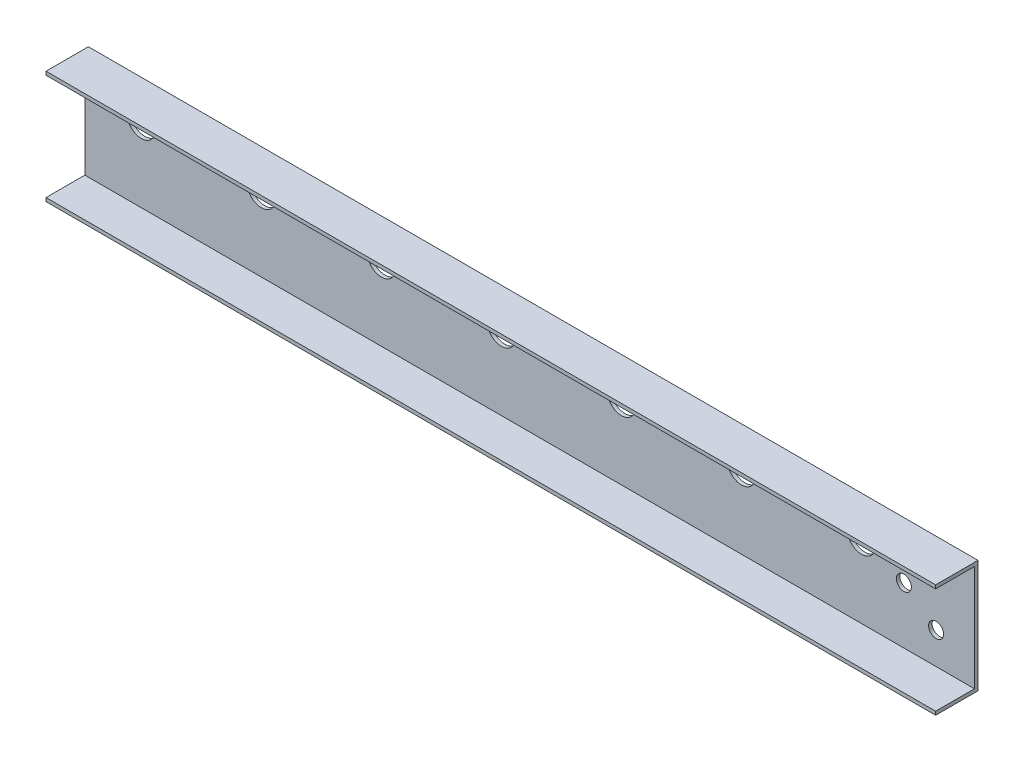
ISO-10303-21;
HEADER;
FILE_DESCRIPTION(('STEP AP214'),'2;1');
FILE_NAME('part.step','',(''),(''),'','','');
FILE_SCHEMA(('AUTOMOTIVE_DESIGN { 1 0 10303 214 1 1 1 1 }'));
ENDSEC;
DATA;
#1=APPLICATION_CONTEXT('core data for automotive mechanical design processes');
#2=APPLICATION_PROTOCOL_DEFINITION('international standard','automotive_design',2000,#1);
#3=PRODUCT_CONTEXT('',#1,'mechanical');
#4=PRODUCT('Part','Part','',(#3));
#5=PRODUCT_RELATED_PRODUCT_CATEGORY('part','',(#4));
#6=PRODUCT_DEFINITION_FORMATION('','',#4);
#7=PRODUCT_DEFINITION_CONTEXT('part definition',#1,'design');
#8=PRODUCT_DEFINITION('design','',#6,#7);
#9=PRODUCT_DEFINITION_SHAPE('','',#8);
#10=(LENGTH_UNIT() NAMED_UNIT(*) SI_UNIT(.MILLI.,.METRE.));
#11=(NAMED_UNIT(*) PLANE_ANGLE_UNIT() SI_UNIT($,.RADIAN.));
#12=(NAMED_UNIT(*) SI_UNIT($,.STERADIAN.) SOLID_ANGLE_UNIT());
#13=UNCERTAINTY_MEASURE_WITH_UNIT(LENGTH_MEASURE(1.E-05),#10,'distance_accuracy_value','');
#14=(GEOMETRIC_REPRESENTATION_CONTEXT(3) GLOBAL_UNCERTAINTY_ASSIGNED_CONTEXT((#13)) GLOBAL_UNIT_ASSIGNED_CONTEXT((#10,
#11,#12)) REPRESENTATION_CONTEXT('',''));
#15=CARTESIAN_POINT('',(0.,0.,0.));
#16=DIRECTION('',(0.,0.,1.));
#17=DIRECTION('',(1.,0.,0.));
#18=AXIS2_PLACEMENT_3D('',#15,#16,#17);
#19=CARTESIAN_POINT('',(800.1,-3.17499999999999,38.1));
#20=DIRECTION('',(0.,0.,1.));
#21=DIRECTION('',(1.,0.,0.));
#22=AXIS2_PLACEMENT_3D('',#19,#20,#21);
#23=PLANE('',#22);
#24=DIRECTION('',(0.,1.,0.));
#25=VECTOR('',#24,1.);
#26=CARTESIAN_POINT('',(0.,-3.17499999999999,38.1));
#27=LINE('',#26,#25);
#28=CARTESIAN_POINT('',(0.,-3.17499999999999,38.1));
#29=VERTEX_POINT('',#28);
#30=CARTESIAN_POINT('',(0.,0.,38.1));
#31=VERTEX_POINT('',#30);
#32=EDGE_CURVE('E132',#29,#31,#27,.T.);
#33=ORIENTED_EDGE('',*,*,#32,.F.);
#34=DIRECTION('',(-1.,0.,0.));
#35=VECTOR('',#34,1.);
#36=CARTESIAN_POINT('',(800.1,-3.17499999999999,38.1));
#37=LINE('',#36,#35);
#38=CARTESIAN_POINT('',(800.1,-3.17499999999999,38.1));
#39=VERTEX_POINT('',#38);
#40=EDGE_CURVE('E49',#39,#29,#37,.T.);
#41=ORIENTED_EDGE('',*,*,#40,.F.);
#42=DIRECTION('',(0.,1.,0.));
#43=VECTOR('',#42,1.);
#44=CARTESIAN_POINT('',(800.1,-3.17499999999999,38.1));
#45=LINE('',#44,#43);
#46=CARTESIAN_POINT('',(800.1,0.,38.1));
#47=VERTEX_POINT('',#46);
#48=EDGE_CURVE('E154',#39,#47,#45,.T.);
#49=ORIENTED_EDGE('',*,*,#48,.T.);
#50=DIRECTION('',(-1.,0.,0.));
#51=VECTOR('',#50,1.);
#52=CARTESIAN_POINT('',(800.1,0.,38.1));
#53=LINE('',#52,#51);
#54=EDGE_CURVE('E131',#47,#31,#53,.T.);
#55=ORIENTED_EDGE('',*,*,#54,.T.);
#56=EDGE_LOOP('',(#33,#41,#49,#55));
#57=FACE_BOUND('',#56,.T.);
#58=ADVANCED_FACE('F32',(#57),#23,.T.);
#59=CARTESIAN_POINT('',(800.1,-3.175,0.));
#60=DIRECTION('',(0.,-1.,0.));
#61=DIRECTION('',(0.,0.,-1.));
#62=AXIS2_PLACEMENT_3D('',#59,#60,#61);
#63=PLANE('',#62);
#64=DIRECTION('',(0.,0.,1.));
#65=VECTOR('',#64,1.);
#66=CARTESIAN_POINT('',(0.,-3.175,0.));
#67=LINE('',#66,#65);
#68=CARTESIAN_POINT('',(0.,-3.175,3.175));
#69=VERTEX_POINT('',#68);
#70=EDGE_CURVE('E151',#69,#29,#67,.T.);
#71=ORIENTED_EDGE('',*,*,#70,.F.);
#72=DIRECTION('',(-1.,0.,0.));
#73=VECTOR('',#72,1.);
#74=CARTESIAN_POINT('',(800.1,-3.175,3.175));
#75=LINE('',#74,#73);
#76=CARTESIAN_POINT('',(800.1,-3.175,3.175));
#77=VERTEX_POINT('',#76);
#78=EDGE_CURVE('E77',#77,#69,#75,.T.);
#79=ORIENTED_EDGE('',*,*,#78,.F.);
#80=DIRECTION('',(0.,0.,1.));
#81=VECTOR('',#80,1.);
#82=CARTESIAN_POINT('',(800.1,-3.175,0.));
#83=LINE('',#82,#81);
#84=EDGE_CURVE('E110',#77,#39,#83,.T.);
#85=ORIENTED_EDGE('',*,*,#84,.T.);
#86=ORIENTED_EDGE('',*,*,#40,.T.);
#87=EDGE_LOOP('',(#71,#79,#85,#86));
#88=FACE_BOUND('',#87,.T.);
#89=ADVANCED_FACE('F211',(#88),#63,.T.);
#90=CARTESIAN_POINT('',(800.1,0.,3.175));
#91=DIRECTION('',(0.,0.,-1.));
#92=DIRECTION('',(0.,1.,0.));
#93=AXIS2_PLACEMENT_3D('',#90,#91,#92);
#94=PLANE('',#93);
#95=CARTESIAN_POINT('',(736.6,-47.625,3.175));
#96=DIRECTION('',(0.,0.,1.));
#97=DIRECTION('',(1.,0.,0.));
#98=AXIS2_PLACEMENT_3D('',#95,#96,#97);
#99=CIRCLE('',#98,6.74370000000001);
#100=CARTESIAN_POINT('',(743.3437,-47.625,3.175));
#101=VERTEX_POINT('',#100);
#102=EDGE_CURVE('E297',#101,#101,#99,.T.);
#103=ORIENTED_EDGE('',*,*,#102,.F.);
#104=EDGE_LOOP('',(#103));
#105=FACE_BOUND('',#104,.T.);
#106=CARTESIAN_POINT('',(765.564183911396,-25.4,3.175));
#107=DIRECTION('',(0.,0.,1.));
#108=DIRECTION('',(1.,0.,0.));
#109=AXIS2_PLACEMENT_3D('',#106,#107,#108);
#110=CIRCLE('',#109,6.74370000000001);
#111=CARTESIAN_POINT('',(772.307883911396,-25.4,3.175));
#112=VERTEX_POINT('',#111);
#113=EDGE_CURVE('E291',#112,#112,#110,.T.);
#114=ORIENTED_EDGE('',*,*,#113,.F.);
#115=EDGE_LOOP('',(#114));
#116=FACE_BOUND('',#115,.T.);
#117=CARTESIAN_POINT('',(765.564183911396,-69.85,3.175));
#118=DIRECTION('',(0.,0.,1.));
#119=DIRECTION('',(1.,0.,0.));
#120=AXIS2_PLACEMENT_3D('',#117,#118,#119);
#121=CIRCLE('',#120,6.74370000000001);
#122=CARTESIAN_POINT('',(772.307883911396,-69.85,3.175));
#123=VERTEX_POINT('',#122);
#124=EDGE_CURVE('E285',#123,#123,#121,.T.);
#125=ORIENTED_EDGE('',*,*,#124,.F.);
#126=EDGE_LOOP('',(#125));
#127=FACE_BOUND('',#126,.T.);
#128=CARTESIAN_POINT('',(158.75,-31.75,3.17500000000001));
#129=DIRECTION('',(0.,0.,-1.));
#130=DIRECTION('',(0.,1.,0.));
#131=AXIS2_PLACEMENT_3D('',#128,#129,#130);
#132=CIRCLE('',#131,12.7);
#133=CARTESIAN_POINT('',(158.75,-19.05,3.175));
#134=VERTEX_POINT('',#133);
#135=EDGE_CURVE('E278',#134,#134,#132,.T.);
#136=ORIENTED_EDGE('',*,*,#135,.T.);
#137=EDGE_LOOP('',(#136));
#138=FACE_BOUND('',#137,.T.);
#139=CARTESIAN_POINT('',(50.8,-31.75,3.17500000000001));
#140=DIRECTION('',(0.,0.,-1.));
#141=DIRECTION('',(0.,1.,0.));
#142=AXIS2_PLACEMENT_3D('',#139,#140,#141);
#143=CIRCLE('',#142,12.7);
#144=CARTESIAN_POINT('',(50.8,-19.05,3.175));
#145=VERTEX_POINT('',#144);
#146=EDGE_CURVE('E136',#145,#145,#143,.T.);
#147=ORIENTED_EDGE('',*,*,#146,.T.);
#148=EDGE_LOOP('',(#147));
#149=FACE_BOUND('',#148,.T.);
#150=DIRECTION('',(0.,-1.,0.));
#151=VECTOR('',#150,1.);
#152=CARTESIAN_POINT('',(0.,0.,3.175));
#153=LINE('',#152,#151);
#154=CARTESIAN_POINT('',(0.,-98.425,3.17500000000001));
#155=VERTEX_POINT('',#154);
#156=EDGE_CURVE('E116',#69,#155,#153,.T.);
#157=ORIENTED_EDGE('',*,*,#156,.T.);
#158=DIRECTION('',(-1.,0.,0.));
#159=VECTOR('',#158,1.);
#160=CARTESIAN_POINT('',(800.1,-98.425,3.17500000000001));
#161=LINE('',#160,#159);
#162=CARTESIAN_POINT('',(800.1,-98.425,3.17500000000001));
#163=VERTEX_POINT('',#162);
#164=EDGE_CURVE('E113',#163,#155,#161,.T.);
#165=ORIENTED_EDGE('',*,*,#164,.F.);
#166=DIRECTION('',(0.,-1.,0.));
#167=VECTOR('',#166,1.);
#168=CARTESIAN_POINT('',(800.1,0.,3.175));
#169=LINE('',#168,#167);
#170=EDGE_CURVE('E104',#77,#163,#169,.T.);
#171=ORIENTED_EDGE('',*,*,#170,.F.);
#172=ORIENTED_EDGE('',*,*,#78,.T.);
#173=EDGE_LOOP('',(#157,#165,#171,#172));
#174=FACE_BOUND('',#173,.T.);
#175=CARTESIAN_POINT('',(266.7,-31.75,3.17500000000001));
#176=DIRECTION('',(0.,0.,-1.));
#177=DIRECTION('',(0.,1.,0.));
#178=AXIS2_PLACEMENT_3D('',#175,#176,#177);
#179=CIRCLE('',#178,12.7);
#180=CARTESIAN_POINT('',(266.7,-19.05,3.175));
#181=VERTEX_POINT('',#180);
#182=EDGE_CURVE('E168',#181,#181,#179,.T.);
#183=ORIENTED_EDGE('',*,*,#182,.T.);
#184=EDGE_LOOP('',(#183));
#185=FACE_BOUND('',#184,.T.);
#186=CARTESIAN_POINT('',(374.65,-31.75,3.17500000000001));
#187=DIRECTION('',(0.,0.,-1.));
#188=DIRECTION('',(0.,1.,0.));
#189=AXIS2_PLACEMENT_3D('',#186,#187,#188);
#190=CIRCLE('',#189,12.7);
#191=CARTESIAN_POINT('',(374.65,-19.05,3.175));
#192=VERTEX_POINT('',#191);
#193=EDGE_CURVE('E174',#192,#192,#190,.T.);
#194=ORIENTED_EDGE('',*,*,#193,.T.);
#195=EDGE_LOOP('',(#194));
#196=FACE_BOUND('',#195,.T.);
#197=CARTESIAN_POINT('',(482.6,-31.75,3.17500000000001));
#198=DIRECTION('',(0.,0.,-1.));
#199=DIRECTION('',(0.,1.,0.));
#200=AXIS2_PLACEMENT_3D('',#197,#198,#199);
#201=CIRCLE('',#200,12.7);
#202=CARTESIAN_POINT('',(482.6,-19.05,3.175));
#203=VERTEX_POINT('',#202);
#204=EDGE_CURVE('E180',#203,#203,#201,.T.);
#205=ORIENTED_EDGE('',*,*,#204,.T.);
#206=EDGE_LOOP('',(#205));
#207=FACE_BOUND('',#206,.T.);
#208=CARTESIAN_POINT('',(590.55,-31.75,3.17500000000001));
#209=DIRECTION('',(0.,0.,-1.));
#210=DIRECTION('',(0.,1.,0.));
#211=AXIS2_PLACEMENT_3D('',#208,#209,#210);
#212=CIRCLE('',#211,12.7);
#213=CARTESIAN_POINT('',(590.55,-19.05,3.175));
#214=VERTEX_POINT('',#213);
#215=EDGE_CURVE('E186',#214,#214,#212,.T.);
#216=ORIENTED_EDGE('',*,*,#215,.T.);
#217=EDGE_LOOP('',(#216));
#218=FACE_BOUND('',#217,.T.);
#219=CARTESIAN_POINT('',(698.5,-31.75,3.17500000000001));
#220=DIRECTION('',(0.,0.,-1.));
#221=DIRECTION('',(0.,1.,0.));
#222=AXIS2_PLACEMENT_3D('',#219,#220,#221);
#223=CIRCLE('',#222,12.7);
#224=CARTESIAN_POINT('',(698.5,-19.05,3.175));
#225=VERTEX_POINT('',#224);
#226=EDGE_CURVE('E11',#225,#225,#223,.T.);
#227=ORIENTED_EDGE('',*,*,#226,.T.);
#228=EDGE_LOOP('',(#227));
#229=FACE_BOUND('',#228,.T.);
#230=ADVANCED_FACE('F114',(#105,#116,#127,#138,#149,#174,#185,#196,#207,#218,#229),#94,.F.);
#231=CARTESIAN_POINT('',(800.1,-98.425,0.));
#232=DIRECTION('',(0.,-1.,0.));
#233=DIRECTION('',(0.,0.,-1.));
#234=AXIS2_PLACEMENT_3D('',#231,#232,#233);
#235=PLANE('',#234);
#236=DIRECTION('',(0.,0.,-1.));
#237=VECTOR('',#236,1.);
#238=CARTESIAN_POINT('',(0.,-98.425,0.));
#239=LINE('',#238,#237);
#240=CARTESIAN_POINT('',(0.,-98.425,38.1));
#241=VERTEX_POINT('',#240);
#242=EDGE_CURVE('E148',#155,#241,#239,.F.);
#243=ORIENTED_EDGE('',*,*,#242,.T.);
#244=DIRECTION('',(-1.,0.,0.));
#245=VECTOR('',#244,1.);
#246=CARTESIAN_POINT('',(800.1,-98.425,38.1));
#247=LINE('',#246,#245);
#248=CARTESIAN_POINT('',(800.1,-98.425,38.1));
#249=VERTEX_POINT('',#248);
#250=EDGE_CURVE('E119',#249,#241,#247,.T.);
#251=ORIENTED_EDGE('',*,*,#250,.F.);
#252=DIRECTION('',(0.,0.,-1.));
#253=VECTOR('',#252,1.);
#254=CARTESIAN_POINT('',(800.1,-98.425,0.));
#255=LINE('',#254,#253);
#256=EDGE_CURVE('E108',#163,#249,#255,.F.);
#257=ORIENTED_EDGE('',*,*,#256,.F.);
#258=ORIENTED_EDGE('',*,*,#164,.T.);
#259=EDGE_LOOP('',(#243,#251,#257,#258));
#260=FACE_BOUND('',#259,.T.);
#261=ADVANCED_FACE('F121',(#260),#235,.F.);
#262=CARTESIAN_POINT('',(800.1,-98.425,38.1));
#263=DIRECTION('',(0.,0.,-1.));
#264=DIRECTION('',(-1.,0.,0.));
#265=AXIS2_PLACEMENT_3D('',#262,#263,#264);
#266=PLANE('',#265);
#267=DIRECTION('',(0.,-1.,0.));
#268=VECTOR('',#267,1.);
#269=CARTESIAN_POINT('',(0.,-98.425,38.1));
#270=LINE('',#269,#268);
#271=CARTESIAN_POINT('',(0.,-101.6,38.1));
#272=VERTEX_POINT('',#271);
#273=EDGE_CURVE('E145',#241,#272,#270,.T.);
#274=ORIENTED_EDGE('',*,*,#273,.T.);
#275=DIRECTION('',(-1.,0.,0.));
#276=VECTOR('',#275,1.);
#277=CARTESIAN_POINT('',(800.1,-101.6,38.1));
#278=LINE('',#277,#276);
#279=CARTESIAN_POINT('',(800.1,-101.6,38.1));
#280=VERTEX_POINT('',#279);
#281=EDGE_CURVE('E159',#280,#272,#278,.T.);
#282=ORIENTED_EDGE('',*,*,#281,.F.);
#283=DIRECTION('',(0.,-1.,0.));
#284=VECTOR('',#283,1.);
#285=CARTESIAN_POINT('',(800.1,-98.425,38.1));
#286=LINE('',#285,#284);
#287=EDGE_CURVE('E124',#249,#280,#286,.T.);
#288=ORIENTED_EDGE('',*,*,#287,.F.);
#289=ORIENTED_EDGE('',*,*,#250,.T.);
#290=EDGE_LOOP('',(#274,#282,#288,#289));
#291=FACE_BOUND('',#290,.T.);
#292=ADVANCED_FACE('F205',(#291),#266,.F.);
#293=CARTESIAN_POINT('',(800.1,-101.6,0.));
#294=DIRECTION('',(0.,-1.,0.));
#295=DIRECTION('',(0.,0.,-1.));
#296=AXIS2_PLACEMENT_3D('',#293,#294,#295);
#297=PLANE('',#296);
#298=DIRECTION('',(0.,0.,1.));
#299=VECTOR('',#298,1.);
#300=CARTESIAN_POINT('',(0.,-101.6,0.));
#301=LINE('',#300,#299);
#302=CARTESIAN_POINT('',(0.,-101.6,0.));
#303=VERTEX_POINT('',#302);
#304=EDGE_CURVE('E142',#303,#272,#301,.T.);
#305=ORIENTED_EDGE('',*,*,#304,.F.);
#306=DIRECTION('',(-1.,0.,0.));
#307=VECTOR('',#306,1.);
#308=CARTESIAN_POINT('',(800.1,-101.6,0.));
#309=LINE('',#308,#307);
#310=CARTESIAN_POINT('',(800.1,-101.6,0.));
#311=VERTEX_POINT('',#310);
#312=EDGE_CURVE('E161',#311,#303,#309,.T.);
#313=ORIENTED_EDGE('',*,*,#312,.F.);
#314=DIRECTION('',(0.,0.,1.));
#315=VECTOR('',#314,1.);
#316=CARTESIAN_POINT('',(800.1,-101.6,0.));
#317=LINE('',#316,#315);
#318=EDGE_CURVE('E126',#311,#280,#317,.T.);
#319=ORIENTED_EDGE('',*,*,#318,.T.);
#320=ORIENTED_EDGE('',*,*,#281,.T.);
#321=EDGE_LOOP('',(#305,#313,#319,#320));
#322=FACE_BOUND('',#321,.T.);
#323=ADVANCED_FACE('F196',(#322),#297,.T.);
#324=CARTESIAN_POINT('',(800.1,0.,0.));
#325=DIRECTION('',(0.,0.,-1.));
#326=DIRECTION('',(0.,1.,0.));
#327=AXIS2_PLACEMENT_3D('',#324,#325,#326);
#328=PLANE('',#327);
#329=CARTESIAN_POINT('',(736.6,-47.625,0.));
#330=DIRECTION('',(0.,0.,1.));
#331=DIRECTION('',(1.,0.,0.));
#332=AXIS2_PLACEMENT_3D('',#329,#330,#331);
#333=CIRCLE('',#332,6.74370000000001);
#334=CARTESIAN_POINT('',(743.3437,-47.625,0.));
#335=VERTEX_POINT('',#334);
#336=EDGE_CURVE('E294',#335,#335,#333,.T.);
#337=ORIENTED_EDGE('',*,*,#336,.T.);
#338=EDGE_LOOP('',(#337));
#339=FACE_BOUND('',#338,.T.);
#340=CARTESIAN_POINT('',(765.564183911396,-25.4,0.));
#341=DIRECTION('',(0.,0.,1.));
#342=DIRECTION('',(1.,0.,0.));
#343=AXIS2_PLACEMENT_3D('',#340,#341,#342);
#344=CIRCLE('',#343,6.74370000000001);
#345=CARTESIAN_POINT('',(772.307883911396,-25.4,0.));
#346=VERTEX_POINT('',#345);
#347=EDGE_CURVE('E288',#346,#346,#344,.T.);
#348=ORIENTED_EDGE('',*,*,#347,.T.);
#349=EDGE_LOOP('',(#348));
#350=FACE_BOUND('',#349,.T.);
#351=CARTESIAN_POINT('',(765.564183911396,-69.85,0.));
#352=DIRECTION('',(0.,0.,1.));
#353=DIRECTION('',(1.,0.,0.));
#354=AXIS2_PLACEMENT_3D('',#351,#352,#353);
#355=CIRCLE('',#354,6.74370000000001);
#356=CARTESIAN_POINT('',(772.307883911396,-69.85,0.));
#357=VERTEX_POINT('',#356);
#358=EDGE_CURVE('E284',#357,#357,#355,.T.);
#359=ORIENTED_EDGE('',*,*,#358,.T.);
#360=EDGE_LOOP('',(#359));
#361=FACE_BOUND('',#360,.T.);
#362=CARTESIAN_POINT('',(158.75,-31.75,0.));
#363=DIRECTION('',(0.,0.,-1.));
#364=DIRECTION('',(0.,1.,0.));
#365=AXIS2_PLACEMENT_3D('',#362,#363,#364);
#366=CIRCLE('',#365,12.7);
#367=CARTESIAN_POINT('',(158.75,-19.05,0.));
#368=VERTEX_POINT('',#367);
#369=EDGE_CURVE('E281',#368,#368,#366,.T.);
#370=ORIENTED_EDGE('',*,*,#369,.F.);
#371=EDGE_LOOP('',(#370));
#372=FACE_BOUND('',#371,.T.);
#373=CARTESIAN_POINT('',(50.8,-31.75,0.));
#374=DIRECTION('',(0.,0.,-1.));
#375=DIRECTION('',(0.,1.,0.));
#376=AXIS2_PLACEMENT_3D('',#373,#374,#375);
#377=CIRCLE('',#376,12.7);
#378=CARTESIAN_POINT('',(50.8,-19.05,0.));
#379=VERTEX_POINT('',#378);
#380=EDGE_CURVE('E275',#379,#379,#377,.T.);
#381=ORIENTED_EDGE('',*,*,#380,.F.);
#382=EDGE_LOOP('',(#381));
#383=FACE_BOUND('',#382,.T.);
#384=DIRECTION('',(0.,-1.,0.));
#385=VECTOR('',#384,1.);
#386=CARTESIAN_POINT('',(0.,0.,0.));
#387=LINE('',#386,#385);
#388=CARTESIAN_POINT('',(0.,0.,0.));
#389=VERTEX_POINT('',#388);
#390=EDGE_CURVE('E139',#389,#303,#387,.T.);
#391=ORIENTED_EDGE('',*,*,#390,.F.);
#392=DIRECTION('',(-1.,0.,0.));
#393=VECTOR('',#392,1.);
#394=CARTESIAN_POINT('',(800.1,0.,0.));
#395=LINE('',#394,#393);
#396=CARTESIAN_POINT('',(800.1,0.,0.));
#397=VERTEX_POINT('',#396);
#398=EDGE_CURVE('E163',#397,#389,#395,.T.);
#399=ORIENTED_EDGE('',*,*,#398,.F.);
#400=DIRECTION('',(0.,-1.,0.));
#401=VECTOR('',#400,1.);
#402=CARTESIAN_POINT('',(800.1,0.,0.));
#403=LINE('',#402,#401);
#404=EDGE_CURVE('E268',#397,#311,#403,.T.);
#405=ORIENTED_EDGE('',*,*,#404,.T.);
#406=ORIENTED_EDGE('',*,*,#312,.T.);
#407=EDGE_LOOP('',(#391,#399,#405,#406));
#408=FACE_BOUND('',#407,.T.);
#409=CARTESIAN_POINT('',(266.7,-31.75,0.));
#410=DIRECTION('',(0.,0.,-1.));
#411=DIRECTION('',(0.,1.,0.));
#412=AXIS2_PLACEMENT_3D('',#409,#410,#411);
#413=CIRCLE('',#412,12.7);
#414=CARTESIAN_POINT('',(266.7,-19.05,0.));
#415=VERTEX_POINT('',#414);
#416=EDGE_CURVE('E156',#415,#415,#413,.T.);
#417=ORIENTED_EDGE('',*,*,#416,.F.);
#418=EDGE_LOOP('',(#417));
#419=FACE_BOUND('',#418,.T.);
#420=CARTESIAN_POINT('',(374.65,-31.75,0.));
#421=DIRECTION('',(0.,0.,-1.));
#422=DIRECTION('',(0.,1.,0.));
#423=AXIS2_PLACEMENT_3D('',#420,#421,#422);
#424=CIRCLE('',#423,12.7);
#425=CARTESIAN_POINT('',(374.65,-19.05,0.));
#426=VERTEX_POINT('',#425);
#427=EDGE_CURVE('E171',#426,#426,#424,.T.);
#428=ORIENTED_EDGE('',*,*,#427,.F.);
#429=EDGE_LOOP('',(#428));
#430=FACE_BOUND('',#429,.T.);
#431=CARTESIAN_POINT('',(482.6,-31.75,0.));
#432=DIRECTION('',(0.,0.,-1.));
#433=DIRECTION('',(0.,1.,0.));
#434=AXIS2_PLACEMENT_3D('',#431,#432,#433);
#435=CIRCLE('',#434,12.7);
#436=CARTESIAN_POINT('',(482.6,-19.05,0.));
#437=VERTEX_POINT('',#436);
#438=EDGE_CURVE('E177',#437,#437,#435,.T.);
#439=ORIENTED_EDGE('',*,*,#438,.F.);
#440=EDGE_LOOP('',(#439));
#441=FACE_BOUND('',#440,.T.);
#442=CARTESIAN_POINT('',(590.55,-31.75,0.));
#443=DIRECTION('',(0.,0.,-1.));
#444=DIRECTION('',(0.,1.,0.));
#445=AXIS2_PLACEMENT_3D('',#442,#443,#444);
#446=CIRCLE('',#445,12.7);
#447=CARTESIAN_POINT('',(590.55,-19.05,0.));
#448=VERTEX_POINT('',#447);
#449=EDGE_CURVE('E183',#448,#448,#446,.T.);
#450=ORIENTED_EDGE('',*,*,#449,.F.);
#451=EDGE_LOOP('',(#450));
#452=FACE_BOUND('',#451,.T.);
#453=CARTESIAN_POINT('',(698.5,-31.75,0.));
#454=DIRECTION('',(0.,0.,-1.));
#455=DIRECTION('',(0.,1.,0.));
#456=AXIS2_PLACEMENT_3D('',#453,#454,#455);
#457=CIRCLE('',#456,12.7);
#458=CARTESIAN_POINT('',(698.5,-19.05,0.));
#459=VERTEX_POINT('',#458);
#460=EDGE_CURVE('E41',#459,#459,#457,.T.);
#461=ORIENTED_EDGE('',*,*,#460,.F.);
#462=EDGE_LOOP('',(#461));
#463=FACE_BOUND('',#462,.T.);
#464=ADVANCED_FACE('F193',(#339,#350,#361,#372,#383,#408,#419,#430,#441,#452,#463),#328,.T.);
#465=CARTESIAN_POINT('',(800.1,0.,0.));
#466=DIRECTION('',(0.,-1.,0.));
#467=DIRECTION('',(0.,0.,-1.));
#468=AXIS2_PLACEMENT_3D('',#465,#466,#467);
#469=PLANE('',#468);
#470=DIRECTION('',(0.,0.,1.));
#471=VECTOR('',#470,1.);
#472=CARTESIAN_POINT('',(0.,0.,0.));
#473=LINE('',#472,#471);
#474=EDGE_CURVE('E135',#389,#31,#473,.T.);
#475=ORIENTED_EDGE('',*,*,#474,.T.);
#476=ORIENTED_EDGE('',*,*,#54,.F.);
#477=DIRECTION('',(0.,0.,1.));
#478=VECTOR('',#477,1.);
#479=CARTESIAN_POINT('',(800.1,0.,0.));
#480=LINE('',#479,#478);
#481=EDGE_CURVE('E89',#397,#47,#480,.T.);
#482=ORIENTED_EDGE('',*,*,#481,.F.);
#483=ORIENTED_EDGE('',*,*,#398,.T.);
#484=EDGE_LOOP('',(#475,#476,#482,#483));
#485=FACE_BOUND('',#484,.T.);
#486=ADVANCED_FACE('F195',(#485),#469,.F.);
#487=CARTESIAN_POINT('',(800.1,-101.6,38.1));
#488=DIRECTION('',(1.,0.,0.));
#489=DIRECTION('',(0.,0.,-1.));
#490=AXIS2_PLACEMENT_3D('',#487,#488,#489);
#491=PLANE('',#490);
#492=ORIENTED_EDGE('',*,*,#48,.F.);
#493=ORIENTED_EDGE('',*,*,#84,.F.);
#494=ORIENTED_EDGE('',*,*,#170,.T.);
#495=ORIENTED_EDGE('',*,*,#256,.T.);
#496=ORIENTED_EDGE('',*,*,#287,.T.);
#497=ORIENTED_EDGE('',*,*,#318,.F.);
#498=ORIENTED_EDGE('',*,*,#404,.F.);
#499=ORIENTED_EDGE('',*,*,#481,.T.);
#500=EDGE_LOOP('',(#492,#493,#494,#495,#496,#497,#498,#499));
#501=FACE_BOUND('',#500,.T.);
#502=ADVANCED_FACE('F106',(#501),#491,.T.);
#503=CARTESIAN_POINT('',(0.,-101.6,38.1));
#504=DIRECTION('',(1.,0.,0.));
#505=DIRECTION('',(0.,0.,-1.));
#506=AXIS2_PLACEMENT_3D('',#503,#504,#505);
#507=PLANE('',#506);
#508=ORIENTED_EDGE('',*,*,#32,.T.);
#509=ORIENTED_EDGE('',*,*,#474,.F.);
#510=ORIENTED_EDGE('',*,*,#390,.T.);
#511=ORIENTED_EDGE('',*,*,#304,.T.);
#512=ORIENTED_EDGE('',*,*,#273,.F.);
#513=ORIENTED_EDGE('',*,*,#242,.F.);
#514=ORIENTED_EDGE('',*,*,#156,.F.);
#515=ORIENTED_EDGE('',*,*,#70,.T.);
#516=EDGE_LOOP('',(#508,#509,#510,#511,#512,#513,#514,#515));
#517=FACE_BOUND('',#516,.T.);
#518=ADVANCED_FACE('F263',(#517),#507,.F.);
#519=CARTESIAN_POINT('',(50.8,-31.75,38.1));
#520=DIRECTION('',(0.,0.,-1.));
#521=DIRECTION('',(0.,1.,0.));
#522=AXIS2_PLACEMENT_3D('',#519,#520,#521);
#523=CYLINDRICAL_SURFACE('',#522,12.7);
#524=CARTESIAN_POINT('',(50.8,-19.05,0.));
#525=CARTESIAN_POINT('',(50.8,-19.05,0.0330729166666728));
#526=CARTESIAN_POINT('',(50.8,-19.05,0.0661458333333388));
#527=CARTESIAN_POINT('',(50.8,-19.05,0.132291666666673));
#528=CARTESIAN_POINT('',(50.8,-19.05,0.165364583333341));
#529=CARTESIAN_POINT('',(50.8,-19.05,0.231510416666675));
#530=CARTESIAN_POINT('',(50.8,-19.05,0.264583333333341));
#531=CARTESIAN_POINT('',(50.8,-19.05,0.330729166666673));
#532=CARTESIAN_POINT('',(50.8,-19.05,0.363802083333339));
#533=CARTESIAN_POINT('',(50.8,-19.05,0.429947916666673));
#534=CARTESIAN_POINT('',(50.8,-19.05,0.463020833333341));
#535=CARTESIAN_POINT('',(50.8,-19.05,0.529166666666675));
#536=CARTESIAN_POINT('',(50.8,-19.05,0.562239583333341));
#537=CARTESIAN_POINT('',(50.8,-19.05,0.628385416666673));
#538=CARTESIAN_POINT('',(50.8,-19.05,0.661458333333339));
#539=CARTESIAN_POINT('',(50.8,-19.05,0.727604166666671));
#540=CARTESIAN_POINT('',(50.8,-19.05,0.760677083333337));
#541=CARTESIAN_POINT('',(50.8,-19.05,0.826822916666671));
#542=CARTESIAN_POINT('',(50.8,-19.05,0.859895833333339));
#543=CARTESIAN_POINT('',(50.8,-19.05,0.926041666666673));
#544=CARTESIAN_POINT('',(50.8,-19.05,0.959114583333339));
#545=CARTESIAN_POINT('',(50.8,-19.05,1.02526041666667));
#546=CARTESIAN_POINT('',(50.8,-19.05,1.05833333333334));
#547=CARTESIAN_POINT('',(50.8,-19.05,1.12447916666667));
#548=CARTESIAN_POINT('',(50.8,-19.05,1.15755208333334));
#549=CARTESIAN_POINT('',(50.8,-19.05,1.22369791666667));
#550=CARTESIAN_POINT('',(50.8,-19.05,1.25677083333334));
#551=CARTESIAN_POINT('',(50.8,-19.05,1.32291666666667));
#552=CARTESIAN_POINT('',(50.8,-19.05,1.35598958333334));
#553=CARTESIAN_POINT('',(50.8,-19.05,1.42213541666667));
#554=CARTESIAN_POINT('',(50.8,-19.05,1.45520833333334));
#555=CARTESIAN_POINT('',(50.8,-19.05,1.52135416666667));
#556=CARTESIAN_POINT('',(50.8,-19.05,1.55442708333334));
#557=CARTESIAN_POINT('',(50.8,-19.05,1.62057291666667));
#558=CARTESIAN_POINT('',(50.8,-19.05,1.65364583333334));
#559=CARTESIAN_POINT('',(50.8,-19.05,1.71979166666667));
#560=CARTESIAN_POINT('',(50.8,-19.05,1.75286458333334));
#561=CARTESIAN_POINT('',(50.8,-19.05,1.81901041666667));
#562=CARTESIAN_POINT('',(50.8,-19.05,1.85208333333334));
#563=CARTESIAN_POINT('',(50.8,-19.05,1.91822916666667));
#564=CARTESIAN_POINT('',(50.8,-19.05,1.95130208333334));
#565=CARTESIAN_POINT('',(50.8,-19.05,2.01744791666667));
#566=CARTESIAN_POINT('',(50.8,-19.05,2.05052083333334));
#567=CARTESIAN_POINT('',(50.8,-19.05,2.11666666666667));
#568=CARTESIAN_POINT('',(50.8,-19.05,2.14973958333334));
#569=CARTESIAN_POINT('',(50.8,-19.05,2.21588541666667));
#570=CARTESIAN_POINT('',(50.8,-19.05,2.24895833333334));
#571=CARTESIAN_POINT('',(50.8,-19.05,2.31510416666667));
#572=CARTESIAN_POINT('',(50.8,-19.05,2.34817708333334));
#573=CARTESIAN_POINT('',(50.8,-19.05,2.41432291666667));
#574=CARTESIAN_POINT('',(50.8,-19.05,2.44739583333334));
#575=CARTESIAN_POINT('',(50.8,-19.05,2.51354166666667));
#576=CARTESIAN_POINT('',(50.8,-19.05,2.54661458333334));
#577=CARTESIAN_POINT('',(50.8,-19.05,2.61276041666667));
#578=CARTESIAN_POINT('',(50.8,-19.05,2.64583333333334));
#579=CARTESIAN_POINT('',(50.8,-19.05,2.71197916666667));
#580=CARTESIAN_POINT('',(50.8,-19.05,2.74505208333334));
#581=CARTESIAN_POINT('',(50.8,-19.05,2.81119791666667));
#582=CARTESIAN_POINT('',(50.8,-19.05,2.84427083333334));
#583=CARTESIAN_POINT('',(50.8,-19.05,2.91041666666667));
#584=CARTESIAN_POINT('',(50.8,-19.05,2.94348958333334));
#585=CARTESIAN_POINT('',(50.8,-19.05,3.00963541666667));
#586=CARTESIAN_POINT('',(50.8,-19.05,3.04270833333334));
#587=CARTESIAN_POINT('',(50.8,-19.05,3.10885416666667));
#588=CARTESIAN_POINT('',(50.8,-19.05,3.14192708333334));
#589=CARTESIAN_POINT('',(50.8,-19.05,3.175));
#590=B_SPLINE_CURVE_WITH_KNOTS('',3,(#524,#525,#526,#527,#528,#529,#530,#531,#532,#533,#534,
#535,#536,#537,#538,#539,#540,#541,#542,#543,#544,#545,#546,#547,#548,#549,#550,#551,#552,#553,
#554,#555,#556,#557,#558,#559,#560,#561,#562,#563,#564,#565,#566,#567,#568,#569,#570,#571,#572,
#573,#574,#575,#576,#577,#578,#579,#580,#581,#582,#583,#584,#585,#586,#587,#588,#589),
.UNSPECIFIED.,.F.,.F.,(4,2,2,2,2,2,2,2,2,2,2,2,2,2,2,2,2,2,2,2,2,2,2,2,2,2,2,2,2,2,2,2,4),(0.,
0.0992187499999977,0.198437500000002,0.29765625,0.396874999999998,0.496093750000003,0.5953125,
0.694531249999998,0.793749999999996,0.892968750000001,0.992187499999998,1.09140625,1.190625,
1.28984375,1.3890625,1.48828125,1.5875,1.68671875,1.7859375,1.88515625,1.984375,2.08359375,
2.1828125,2.28203125,2.38125,2.48046875,2.5796875,2.67890624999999,2.778125,2.87734375,
2.97656249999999,3.07578125,3.175),.UNSPECIFIED.);
#591=EDGE_CURVE('BSEAM318',#379,#145,#590,.T.);
#592=ORIENTED_EDGE('',*,*,#380,.T.);
#593=ORIENTED_EDGE('',*,*,#146,.F.);
#594=ORIENTED_EDGE('',*,*,#591,.T.);
#595=ORIENTED_EDGE('',*,*,#591,.F.);
#596=EDGE_LOOP('',(#592,#594,#593,#595));
#597=FACE_BOUND('',#596,.T.);
#598=ADVANCED_FACE('F318',(#597),#523,.F.);
#599=CARTESIAN_POINT('',(158.75,-31.75,38.1));
#600=DIRECTION('',(0.,0.,-1.));
#601=DIRECTION('',(0.,1.,0.));
#602=AXIS2_PLACEMENT_3D('',#599,#600,#601);
#603=CYLINDRICAL_SURFACE('',#602,12.7);
#604=CARTESIAN_POINT('',(158.75,-19.05,0.));
#605=CARTESIAN_POINT('',(158.75,-19.05,0.0330729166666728));
#606=CARTESIAN_POINT('',(158.75,-19.05,0.0661458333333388));
#607=CARTESIAN_POINT('',(158.75,-19.05,0.132291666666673));
#608=CARTESIAN_POINT('',(158.75,-19.05,0.165364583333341));
#609=CARTESIAN_POINT('',(158.75,-19.05,0.231510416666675));
#610=CARTESIAN_POINT('',(158.75,-19.05,0.264583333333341));
#611=CARTESIAN_POINT('',(158.75,-19.05,0.330729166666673));
#612=CARTESIAN_POINT('',(158.75,-19.05,0.363802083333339));
#613=CARTESIAN_POINT('',(158.75,-19.05,0.429947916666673));
#614=CARTESIAN_POINT('',(158.75,-19.05,0.463020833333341));
#615=CARTESIAN_POINT('',(158.75,-19.05,0.529166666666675));
#616=CARTESIAN_POINT('',(158.75,-19.05,0.562239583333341));
#617=CARTESIAN_POINT('',(158.75,-19.05,0.628385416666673));
#618=CARTESIAN_POINT('',(158.75,-19.05,0.661458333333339));
#619=CARTESIAN_POINT('',(158.75,-19.05,0.727604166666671));
#620=CARTESIAN_POINT('',(158.75,-19.05,0.760677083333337));
#621=CARTESIAN_POINT('',(158.75,-19.05,0.826822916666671));
#622=CARTESIAN_POINT('',(158.75,-19.05,0.859895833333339));
#623=CARTESIAN_POINT('',(158.75,-19.05,0.926041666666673));
#624=CARTESIAN_POINT('',(158.75,-19.05,0.959114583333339));
#625=CARTESIAN_POINT('',(158.75,-19.05,1.02526041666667));
#626=CARTESIAN_POINT('',(158.75,-19.05,1.05833333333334));
#627=CARTESIAN_POINT('',(158.75,-19.05,1.12447916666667));
#628=CARTESIAN_POINT('',(158.75,-19.05,1.15755208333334));
#629=CARTESIAN_POINT('',(158.75,-19.05,1.22369791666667));
#630=CARTESIAN_POINT('',(158.75,-19.05,1.25677083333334));
#631=CARTESIAN_POINT('',(158.75,-19.05,1.32291666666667));
#632=CARTESIAN_POINT('',(158.75,-19.05,1.35598958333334));
#633=CARTESIAN_POINT('',(158.75,-19.05,1.42213541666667));
#634=CARTESIAN_POINT('',(158.75,-19.05,1.45520833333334));
#635=CARTESIAN_POINT('',(158.75,-19.05,1.52135416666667));
#636=CARTESIAN_POINT('',(158.75,-19.05,1.55442708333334));
#637=CARTESIAN_POINT('',(158.75,-19.05,1.62057291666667));
#638=CARTESIAN_POINT('',(158.75,-19.05,1.65364583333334));
#639=CARTESIAN_POINT('',(158.75,-19.05,1.71979166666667));
#640=CARTESIAN_POINT('',(158.75,-19.05,1.75286458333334));
#641=CARTESIAN_POINT('',(158.75,-19.05,1.81901041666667));
#642=CARTESIAN_POINT('',(158.75,-19.05,1.85208333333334));
#643=CARTESIAN_POINT('',(158.75,-19.05,1.91822916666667));
#644=CARTESIAN_POINT('',(158.75,-19.05,1.95130208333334));
#645=CARTESIAN_POINT('',(158.75,-19.05,2.01744791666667));
#646=CARTESIAN_POINT('',(158.75,-19.05,2.05052083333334));
#647=CARTESIAN_POINT('',(158.75,-19.05,2.11666666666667));
#648=CARTESIAN_POINT('',(158.75,-19.05,2.14973958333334));
#649=CARTESIAN_POINT('',(158.75,-19.05,2.21588541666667));
#650=CARTESIAN_POINT('',(158.75,-19.05,2.24895833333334));
#651=CARTESIAN_POINT('',(158.75,-19.05,2.31510416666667));
#652=CARTESIAN_POINT('',(158.75,-19.05,2.34817708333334));
#653=CARTESIAN_POINT('',(158.75,-19.05,2.41432291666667));
#654=CARTESIAN_POINT('',(158.75,-19.05,2.44739583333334));
#655=CARTESIAN_POINT('',(158.75,-19.05,2.51354166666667));
#656=CARTESIAN_POINT('',(158.75,-19.05,2.54661458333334));
#657=CARTESIAN_POINT('',(158.75,-19.05,2.61276041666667));
#658=CARTESIAN_POINT('',(158.75,-19.05,2.64583333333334));
#659=CARTESIAN_POINT('',(158.75,-19.05,2.71197916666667));
#660=CARTESIAN_POINT('',(158.75,-19.05,2.74505208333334));
#661=CARTESIAN_POINT('',(158.75,-19.05,2.81119791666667));
#662=CARTESIAN_POINT('',(158.75,-19.05,2.84427083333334));
#663=CARTESIAN_POINT('',(158.75,-19.05,2.91041666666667));
#664=CARTESIAN_POINT('',(158.75,-19.05,2.94348958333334));
#665=CARTESIAN_POINT('',(158.75,-19.05,3.00963541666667));
#666=CARTESIAN_POINT('',(158.75,-19.05,3.04270833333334));
#667=CARTESIAN_POINT('',(158.75,-19.05,3.10885416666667));
#668=CARTESIAN_POINT('',(158.75,-19.05,3.14192708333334));
#669=CARTESIAN_POINT('',(158.75,-19.05,3.175));
#670=B_SPLINE_CURVE_WITH_KNOTS('',3,(#604,#605,#606,#607,#608,#609,#610,#611,#612,#613,#614,
#615,#616,#617,#618,#619,#620,#621,#622,#623,#624,#625,#626,#627,#628,#629,#630,#631,#632,#633,
#634,#635,#636,#637,#638,#639,#640,#641,#642,#643,#644,#645,#646,#647,#648,#649,#650,#651,#652,
#653,#654,#655,#656,#657,#658,#659,#660,#661,#662,#663,#664,#665,#666,#667,#668,#669),
.UNSPECIFIED.,.F.,.F.,(4,2,2,2,2,2,2,2,2,2,2,2,2,2,2,2,2,2,2,2,2,2,2,2,2,2,2,2,2,2,2,2,4),(0.,
0.0992187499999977,0.198437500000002,0.29765625,0.396874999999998,0.496093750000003,0.5953125,
0.694531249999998,0.793749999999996,0.892968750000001,0.992187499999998,1.09140625,1.190625,
1.28984375,1.3890625,1.48828125,1.5875,1.68671875,1.7859375,1.88515625,1.984375,2.08359375,
2.1828125,2.28203125,2.38125,2.48046875,2.5796875,2.67890624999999,2.778125,2.87734375,
2.97656249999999,3.07578125,3.175),.UNSPECIFIED.);
#671=EDGE_CURVE('BSEAM222',#368,#134,#670,.T.);
#672=ORIENTED_EDGE('',*,*,#369,.T.);
#673=ORIENTED_EDGE('',*,*,#135,.F.);
#674=ORIENTED_EDGE('',*,*,#671,.T.);
#675=ORIENTED_EDGE('',*,*,#671,.F.);
#676=EDGE_LOOP('',(#672,#674,#673,#675));
#677=FACE_BOUND('',#676,.T.);
#678=ADVANCED_FACE('F222',(#677),#603,.F.);
#679=CARTESIAN_POINT('',(266.7,-31.75,38.1));
#680=DIRECTION('',(0.,0.,-1.));
#681=DIRECTION('',(0.,1.,0.));
#682=AXIS2_PLACEMENT_3D('',#679,#680,#681);
#683=CYLINDRICAL_SURFACE('',#682,12.7);
#684=CARTESIAN_POINT('',(266.7,-19.05,0.));
#685=CARTESIAN_POINT('',(266.7,-19.05,0.0330729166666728));
#686=CARTESIAN_POINT('',(266.7,-19.05,0.0661458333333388));
#687=CARTESIAN_POINT('',(266.7,-19.05,0.132291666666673));
#688=CARTESIAN_POINT('',(266.7,-19.05,0.165364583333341));
#689=CARTESIAN_POINT('',(266.7,-19.05,0.231510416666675));
#690=CARTESIAN_POINT('',(266.7,-19.05,0.264583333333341));
#691=CARTESIAN_POINT('',(266.7,-19.05,0.330729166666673));
#692=CARTESIAN_POINT('',(266.7,-19.05,0.363802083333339));
#693=CARTESIAN_POINT('',(266.7,-19.05,0.429947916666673));
#694=CARTESIAN_POINT('',(266.7,-19.05,0.463020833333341));
#695=CARTESIAN_POINT('',(266.7,-19.05,0.529166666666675));
#696=CARTESIAN_POINT('',(266.7,-19.05,0.562239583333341));
#697=CARTESIAN_POINT('',(266.7,-19.05,0.628385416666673));
#698=CARTESIAN_POINT('',(266.7,-19.05,0.661458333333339));
#699=CARTESIAN_POINT('',(266.7,-19.05,0.727604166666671));
#700=CARTESIAN_POINT('',(266.7,-19.05,0.760677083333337));
#701=CARTESIAN_POINT('',(266.7,-19.05,0.826822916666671));
#702=CARTESIAN_POINT('',(266.7,-19.05,0.859895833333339));
#703=CARTESIAN_POINT('',(266.7,-19.05,0.926041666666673));
#704=CARTESIAN_POINT('',(266.7,-19.05,0.959114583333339));
#705=CARTESIAN_POINT('',(266.7,-19.05,1.02526041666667));
#706=CARTESIAN_POINT('',(266.7,-19.05,1.05833333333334));
#707=CARTESIAN_POINT('',(266.7,-19.05,1.12447916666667));
#708=CARTESIAN_POINT('',(266.7,-19.05,1.15755208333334));
#709=CARTESIAN_POINT('',(266.7,-19.05,1.22369791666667));
#710=CARTESIAN_POINT('',(266.7,-19.05,1.25677083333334));
#711=CARTESIAN_POINT('',(266.7,-19.05,1.32291666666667));
#712=CARTESIAN_POINT('',(266.7,-19.05,1.35598958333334));
#713=CARTESIAN_POINT('',(266.7,-19.05,1.42213541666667));
#714=CARTESIAN_POINT('',(266.7,-19.05,1.45520833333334));
#715=CARTESIAN_POINT('',(266.7,-19.05,1.52135416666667));
#716=CARTESIAN_POINT('',(266.7,-19.05,1.55442708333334));
#717=CARTESIAN_POINT('',(266.7,-19.05,1.62057291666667));
#718=CARTESIAN_POINT('',(266.7,-19.05,1.65364583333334));
#719=CARTESIAN_POINT('',(266.7,-19.05,1.71979166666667));
#720=CARTESIAN_POINT('',(266.7,-19.05,1.75286458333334));
#721=CARTESIAN_POINT('',(266.7,-19.05,1.81901041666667));
#722=CARTESIAN_POINT('',(266.7,-19.05,1.85208333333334));
#723=CARTESIAN_POINT('',(266.7,-19.05,1.91822916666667));
#724=CARTESIAN_POINT('',(266.7,-19.05,1.95130208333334));
#725=CARTESIAN_POINT('',(266.7,-19.05,2.01744791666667));
#726=CARTESIAN_POINT('',(266.7,-19.05,2.05052083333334));
#727=CARTESIAN_POINT('',(266.7,-19.05,2.11666666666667));
#728=CARTESIAN_POINT('',(266.7,-19.05,2.14973958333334));
#729=CARTESIAN_POINT('',(266.7,-19.05,2.21588541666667));
#730=CARTESIAN_POINT('',(266.7,-19.05,2.24895833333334));
#731=CARTESIAN_POINT('',(266.7,-19.05,2.31510416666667));
#732=CARTESIAN_POINT('',(266.7,-19.05,2.34817708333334));
#733=CARTESIAN_POINT('',(266.7,-19.05,2.41432291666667));
#734=CARTESIAN_POINT('',(266.7,-19.05,2.44739583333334));
#735=CARTESIAN_POINT('',(266.7,-19.05,2.51354166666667));
#736=CARTESIAN_POINT('',(266.7,-19.05,2.54661458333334));
#737=CARTESIAN_POINT('',(266.7,-19.05,2.61276041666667));
#738=CARTESIAN_POINT('',(266.7,-19.05,2.64583333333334));
#739=CARTESIAN_POINT('',(266.7,-19.05,2.71197916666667));
#740=CARTESIAN_POINT('',(266.7,-19.05,2.74505208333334));
#741=CARTESIAN_POINT('',(266.7,-19.05,2.81119791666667));
#742=CARTESIAN_POINT('',(266.7,-19.05,2.84427083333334));
#743=CARTESIAN_POINT('',(266.7,-19.05,2.91041666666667));
#744=CARTESIAN_POINT('',(266.7,-19.05,2.94348958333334));
#745=CARTESIAN_POINT('',(266.7,-19.05,3.00963541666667));
#746=CARTESIAN_POINT('',(266.7,-19.05,3.04270833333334));
#747=CARTESIAN_POINT('',(266.7,-19.05,3.10885416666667));
#748=CARTESIAN_POINT('',(266.7,-19.05,3.14192708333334));
#749=CARTESIAN_POINT('',(266.7,-19.05,3.175));
#750=B_SPLINE_CURVE_WITH_KNOTS('',3,(#684,#685,#686,#687,#688,#689,#690,#691,#692,#693,#694,
#695,#696,#697,#698,#699,#700,#701,#702,#703,#704,#705,#706,#707,#708,#709,#710,#711,#712,#713,
#714,#715,#716,#717,#718,#719,#720,#721,#722,#723,#724,#725,#726,#727,#728,#729,#730,#731,#732,
#733,#734,#735,#736,#737,#738,#739,#740,#741,#742,#743,#744,#745,#746,#747,#748,#749),
.UNSPECIFIED.,.F.,.F.,(4,2,2,2,2,2,2,2,2,2,2,2,2,2,2,2,2,2,2,2,2,2,2,2,2,2,2,2,2,2,2,2,4),(0.,
0.0992187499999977,0.198437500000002,0.29765625,0.396874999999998,0.496093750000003,0.5953125,
0.694531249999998,0.793749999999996,0.892968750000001,0.992187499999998,1.09140625,1.190625,
1.28984375,1.3890625,1.48828125,1.5875,1.68671875,1.7859375,1.88515625,1.984375,2.08359375,
2.1828125,2.28203125,2.38125,2.48046875,2.5796875,2.67890624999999,2.778125,2.87734375,
2.97656249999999,3.07578125,3.175),.UNSPECIFIED.);
#751=EDGE_CURVE('BSEAM218',#415,#181,#750,.T.);
#752=ORIENTED_EDGE('',*,*,#416,.T.);
#753=ORIENTED_EDGE('',*,*,#182,.F.);
#754=ORIENTED_EDGE('',*,*,#751,.T.);
#755=ORIENTED_EDGE('',*,*,#751,.F.);
#756=EDGE_LOOP('',(#752,#754,#753,#755));
#757=FACE_BOUND('',#756,.T.);
#758=ADVANCED_FACE('F218',(#757),#683,.F.);
#759=CARTESIAN_POINT('',(374.65,-31.75,38.1));
#760=DIRECTION('',(0.,0.,-1.));
#761=DIRECTION('',(0.,1.,0.));
#762=AXIS2_PLACEMENT_3D('',#759,#760,#761);
#763=CYLINDRICAL_SURFACE('',#762,12.7);
#764=CARTESIAN_POINT('',(374.65,-19.05,0.));
#765=CARTESIAN_POINT('',(374.65,-19.05,0.0330729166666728));
#766=CARTESIAN_POINT('',(374.65,-19.05,0.0661458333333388));
#767=CARTESIAN_POINT('',(374.65,-19.05,0.132291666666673));
#768=CARTESIAN_POINT('',(374.65,-19.05,0.165364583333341));
#769=CARTESIAN_POINT('',(374.65,-19.05,0.231510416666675));
#770=CARTESIAN_POINT('',(374.65,-19.05,0.264583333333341));
#771=CARTESIAN_POINT('',(374.65,-19.05,0.330729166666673));
#772=CARTESIAN_POINT('',(374.65,-19.05,0.363802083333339));
#773=CARTESIAN_POINT('',(374.65,-19.05,0.429947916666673));
#774=CARTESIAN_POINT('',(374.65,-19.05,0.463020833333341));
#775=CARTESIAN_POINT('',(374.65,-19.05,0.529166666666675));
#776=CARTESIAN_POINT('',(374.65,-19.05,0.562239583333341));
#777=CARTESIAN_POINT('',(374.65,-19.05,0.628385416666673));
#778=CARTESIAN_POINT('',(374.65,-19.05,0.661458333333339));
#779=CARTESIAN_POINT('',(374.65,-19.05,0.727604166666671));
#780=CARTESIAN_POINT('',(374.65,-19.05,0.760677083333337));
#781=CARTESIAN_POINT('',(374.65,-19.05,0.826822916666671));
#782=CARTESIAN_POINT('',(374.65,-19.05,0.859895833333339));
#783=CARTESIAN_POINT('',(374.65,-19.05,0.926041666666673));
#784=CARTESIAN_POINT('',(374.65,-19.05,0.959114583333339));
#785=CARTESIAN_POINT('',(374.65,-19.05,1.02526041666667));
#786=CARTESIAN_POINT('',(374.65,-19.05,1.05833333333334));
#787=CARTESIAN_POINT('',(374.65,-19.05,1.12447916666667));
#788=CARTESIAN_POINT('',(374.65,-19.05,1.15755208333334));
#789=CARTESIAN_POINT('',(374.65,-19.05,1.22369791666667));
#790=CARTESIAN_POINT('',(374.65,-19.05,1.25677083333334));
#791=CARTESIAN_POINT('',(374.65,-19.05,1.32291666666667));
#792=CARTESIAN_POINT('',(374.65,-19.05,1.35598958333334));
#793=CARTESIAN_POINT('',(374.65,-19.05,1.42213541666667));
#794=CARTESIAN_POINT('',(374.65,-19.05,1.45520833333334));
#795=CARTESIAN_POINT('',(374.65,-19.05,1.52135416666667));
#796=CARTESIAN_POINT('',(374.65,-19.05,1.55442708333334));
#797=CARTESIAN_POINT('',(374.65,-19.05,1.62057291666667));
#798=CARTESIAN_POINT('',(374.65,-19.05,1.65364583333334));
#799=CARTESIAN_POINT('',(374.65,-19.05,1.71979166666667));
#800=CARTESIAN_POINT('',(374.65,-19.05,1.75286458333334));
#801=CARTESIAN_POINT('',(374.65,-19.05,1.81901041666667));
#802=CARTESIAN_POINT('',(374.65,-19.05,1.85208333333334));
#803=CARTESIAN_POINT('',(374.65,-19.05,1.91822916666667));
#804=CARTESIAN_POINT('',(374.65,-19.05,1.95130208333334));
#805=CARTESIAN_POINT('',(374.65,-19.05,2.01744791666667));
#806=CARTESIAN_POINT('',(374.65,-19.05,2.05052083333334));
#807=CARTESIAN_POINT('',(374.65,-19.05,2.11666666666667));
#808=CARTESIAN_POINT('',(374.65,-19.05,2.14973958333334));
#809=CARTESIAN_POINT('',(374.65,-19.05,2.21588541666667));
#810=CARTESIAN_POINT('',(374.65,-19.05,2.24895833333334));
#811=CARTESIAN_POINT('',(374.65,-19.05,2.31510416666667));
#812=CARTESIAN_POINT('',(374.65,-19.05,2.34817708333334));
#813=CARTESIAN_POINT('',(374.65,-19.05,2.41432291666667));
#814=CARTESIAN_POINT('',(374.65,-19.05,2.44739583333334));
#815=CARTESIAN_POINT('',(374.65,-19.05,2.51354166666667));
#816=CARTESIAN_POINT('',(374.65,-19.05,2.54661458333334));
#817=CARTESIAN_POINT('',(374.65,-19.05,2.61276041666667));
#818=CARTESIAN_POINT('',(374.65,-19.05,2.64583333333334));
#819=CARTESIAN_POINT('',(374.65,-19.05,2.71197916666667));
#820=CARTESIAN_POINT('',(374.65,-19.05,2.74505208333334));
#821=CARTESIAN_POINT('',(374.65,-19.05,2.81119791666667));
#822=CARTESIAN_POINT('',(374.65,-19.05,2.84427083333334));
#823=CARTESIAN_POINT('',(374.65,-19.05,2.91041666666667));
#824=CARTESIAN_POINT('',(374.65,-19.05,2.94348958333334));
#825=CARTESIAN_POINT('',(374.65,-19.05,3.00963541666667));
#826=CARTESIAN_POINT('',(374.65,-19.05,3.04270833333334));
#827=CARTESIAN_POINT('',(374.65,-19.05,3.10885416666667));
#828=CARTESIAN_POINT('',(374.65,-19.05,3.14192708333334));
#829=CARTESIAN_POINT('',(374.65,-19.05,3.175));
#830=B_SPLINE_CURVE_WITH_KNOTS('',3,(#764,#765,#766,#767,#768,#769,#770,#771,#772,#773,#774,
#775,#776,#777,#778,#779,#780,#781,#782,#783,#784,#785,#786,#787,#788,#789,#790,#791,#792,#793,
#794,#795,#796,#797,#798,#799,#800,#801,#802,#803,#804,#805,#806,#807,#808,#809,#810,#811,#812,
#813,#814,#815,#816,#817,#818,#819,#820,#821,#822,#823,#824,#825,#826,#827,#828,#829),
.UNSPECIFIED.,.F.,.F.,(4,2,2,2,2,2,2,2,2,2,2,2,2,2,2,2,2,2,2,2,2,2,2,2,2,2,2,2,2,2,2,2,4),(0.,
0.0992187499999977,0.198437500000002,0.29765625,0.396874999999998,0.496093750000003,0.5953125,
0.694531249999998,0.793749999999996,0.892968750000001,0.992187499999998,1.09140625,1.190625,
1.28984375,1.3890625,1.48828125,1.5875,1.68671875,1.7859375,1.88515625,1.984375,2.08359375,
2.1828125,2.28203125,2.38125,2.48046875,2.5796875,2.67890624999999,2.778125,2.87734375,
2.97656249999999,3.07578125,3.175),.UNSPECIFIED.);
#831=EDGE_CURVE('BSEAM221',#426,#192,#830,.T.);
#832=ORIENTED_EDGE('',*,*,#427,.T.);
#833=ORIENTED_EDGE('',*,*,#193,.F.);
#834=ORIENTED_EDGE('',*,*,#831,.T.);
#835=ORIENTED_EDGE('',*,*,#831,.F.);
#836=EDGE_LOOP('',(#832,#834,#833,#835));
#837=FACE_BOUND('',#836,.T.);
#838=ADVANCED_FACE('F221',(#837),#763,.F.);
#839=CARTESIAN_POINT('',(482.6,-31.75,38.1));
#840=DIRECTION('',(0.,0.,-1.));
#841=DIRECTION('',(0.,1.,0.));
#842=AXIS2_PLACEMENT_3D('',#839,#840,#841);
#843=CYLINDRICAL_SURFACE('',#842,12.7);
#844=CARTESIAN_POINT('',(482.6,-19.05,0.));
#845=CARTESIAN_POINT('',(482.6,-19.05,0.0330729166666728));
#846=CARTESIAN_POINT('',(482.6,-19.05,0.0661458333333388));
#847=CARTESIAN_POINT('',(482.6,-19.05,0.132291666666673));
#848=CARTESIAN_POINT('',(482.6,-19.05,0.165364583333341));
#849=CARTESIAN_POINT('',(482.6,-19.05,0.231510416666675));
#850=CARTESIAN_POINT('',(482.6,-19.05,0.264583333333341));
#851=CARTESIAN_POINT('',(482.6,-19.05,0.330729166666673));
#852=CARTESIAN_POINT('',(482.6,-19.05,0.363802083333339));
#853=CARTESIAN_POINT('',(482.6,-19.05,0.429947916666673));
#854=CARTESIAN_POINT('',(482.6,-19.05,0.463020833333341));
#855=CARTESIAN_POINT('',(482.6,-19.05,0.529166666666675));
#856=CARTESIAN_POINT('',(482.6,-19.05,0.562239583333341));
#857=CARTESIAN_POINT('',(482.6,-19.05,0.628385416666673));
#858=CARTESIAN_POINT('',(482.6,-19.05,0.661458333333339));
#859=CARTESIAN_POINT('',(482.6,-19.05,0.727604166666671));
#860=CARTESIAN_POINT('',(482.6,-19.05,0.760677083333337));
#861=CARTESIAN_POINT('',(482.6,-19.05,0.826822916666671));
#862=CARTESIAN_POINT('',(482.6,-19.05,0.859895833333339));
#863=CARTESIAN_POINT('',(482.6,-19.05,0.926041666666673));
#864=CARTESIAN_POINT('',(482.6,-19.05,0.959114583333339));
#865=CARTESIAN_POINT('',(482.6,-19.05,1.02526041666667));
#866=CARTESIAN_POINT('',(482.6,-19.05,1.05833333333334));
#867=CARTESIAN_POINT('',(482.6,-19.05,1.12447916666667));
#868=CARTESIAN_POINT('',(482.6,-19.05,1.15755208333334));
#869=CARTESIAN_POINT('',(482.6,-19.05,1.22369791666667));
#870=CARTESIAN_POINT('',(482.6,-19.05,1.25677083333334));
#871=CARTESIAN_POINT('',(482.6,-19.05,1.32291666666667));
#872=CARTESIAN_POINT('',(482.6,-19.05,1.35598958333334));
#873=CARTESIAN_POINT('',(482.6,-19.05,1.42213541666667));
#874=CARTESIAN_POINT('',(482.6,-19.05,1.45520833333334));
#875=CARTESIAN_POINT('',(482.6,-19.05,1.52135416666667));
#876=CARTESIAN_POINT('',(482.6,-19.05,1.55442708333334));
#877=CARTESIAN_POINT('',(482.6,-19.05,1.62057291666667));
#878=CARTESIAN_POINT('',(482.6,-19.05,1.65364583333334));
#879=CARTESIAN_POINT('',(482.6,-19.05,1.71979166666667));
#880=CARTESIAN_POINT('',(482.6,-19.05,1.75286458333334));
#881=CARTESIAN_POINT('',(482.6,-19.05,1.81901041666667));
#882=CARTESIAN_POINT('',(482.6,-19.05,1.85208333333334));
#883=CARTESIAN_POINT('',(482.6,-19.05,1.91822916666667));
#884=CARTESIAN_POINT('',(482.6,-19.05,1.95130208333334));
#885=CARTESIAN_POINT('',(482.6,-19.05,2.01744791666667));
#886=CARTESIAN_POINT('',(482.6,-19.05,2.05052083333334));
#887=CARTESIAN_POINT('',(482.6,-19.05,2.11666666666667));
#888=CARTESIAN_POINT('',(482.6,-19.05,2.14973958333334));
#889=CARTESIAN_POINT('',(482.6,-19.05,2.21588541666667));
#890=CARTESIAN_POINT('',(482.6,-19.05,2.24895833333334));
#891=CARTESIAN_POINT('',(482.6,-19.05,2.31510416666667));
#892=CARTESIAN_POINT('',(482.6,-19.05,2.34817708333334));
#893=CARTESIAN_POINT('',(482.6,-19.05,2.41432291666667));
#894=CARTESIAN_POINT('',(482.6,-19.05,2.44739583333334));
#895=CARTESIAN_POINT('',(482.6,-19.05,2.51354166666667));
#896=CARTESIAN_POINT('',(482.6,-19.05,2.54661458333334));
#897=CARTESIAN_POINT('',(482.6,-19.05,2.61276041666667));
#898=CARTESIAN_POINT('',(482.6,-19.05,2.64583333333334));
#899=CARTESIAN_POINT('',(482.6,-19.05,2.71197916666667));
#900=CARTESIAN_POINT('',(482.6,-19.05,2.74505208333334));
#901=CARTESIAN_POINT('',(482.6,-19.05,2.81119791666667));
#902=CARTESIAN_POINT('',(482.6,-19.05,2.84427083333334));
#903=CARTESIAN_POINT('',(482.6,-19.05,2.91041666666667));
#904=CARTESIAN_POINT('',(482.6,-19.05,2.94348958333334));
#905=CARTESIAN_POINT('',(482.6,-19.05,3.00963541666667));
#906=CARTESIAN_POINT('',(482.6,-19.05,3.04270833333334));
#907=CARTESIAN_POINT('',(482.6,-19.05,3.10885416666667));
#908=CARTESIAN_POINT('',(482.6,-19.05,3.14192708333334));
#909=CARTESIAN_POINT('',(482.6,-19.05,3.175));
#910=B_SPLINE_CURVE_WITH_KNOTS('',3,(#844,#845,#846,#847,#848,#849,#850,#851,#852,#853,#854,
#855,#856,#857,#858,#859,#860,#861,#862,#863,#864,#865,#866,#867,#868,#869,#870,#871,#872,#873,
#874,#875,#876,#877,#878,#879,#880,#881,#882,#883,#884,#885,#886,#887,#888,#889,#890,#891,#892,
#893,#894,#895,#896,#897,#898,#899,#900,#901,#902,#903,#904,#905,#906,#907,#908,#909),
.UNSPECIFIED.,.F.,.F.,(4,2,2,2,2,2,2,2,2,2,2,2,2,2,2,2,2,2,2,2,2,2,2,2,2,2,2,2,2,2,2,2,4),(0.,
0.0992187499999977,0.198437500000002,0.29765625,0.396874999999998,0.496093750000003,0.5953125,
0.694531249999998,0.793749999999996,0.892968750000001,0.992187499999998,1.09140625,1.190625,
1.28984375,1.3890625,1.48828125,1.5875,1.68671875,1.7859375,1.88515625,1.984375,2.08359375,
2.1828125,2.28203125,2.38125,2.48046875,2.5796875,2.67890624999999,2.778125,2.87734375,
2.97656249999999,3.07578125,3.175),.UNSPECIFIED.);
#911=EDGE_CURVE('BSEAM226',#437,#203,#910,.T.);
#912=ORIENTED_EDGE('',*,*,#438,.T.);
#913=ORIENTED_EDGE('',*,*,#204,.F.);
#914=ORIENTED_EDGE('',*,*,#911,.T.);
#915=ORIENTED_EDGE('',*,*,#911,.F.);
#916=EDGE_LOOP('',(#912,#914,#913,#915));
#917=FACE_BOUND('',#916,.T.);
#918=ADVANCED_FACE('F226',(#917),#843,.F.);
#919=CARTESIAN_POINT('',(590.55,-31.75,38.1));
#920=DIRECTION('',(0.,0.,-1.));
#921=DIRECTION('',(0.,1.,0.));
#922=AXIS2_PLACEMENT_3D('',#919,#920,#921);
#923=CYLINDRICAL_SURFACE('',#922,12.7);
#924=CARTESIAN_POINT('',(590.55,-19.05,0.));
#925=CARTESIAN_POINT('',(590.55,-19.05,0.0330729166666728));
#926=CARTESIAN_POINT('',(590.55,-19.05,0.0661458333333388));
#927=CARTESIAN_POINT('',(590.55,-19.05,0.132291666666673));
#928=CARTESIAN_POINT('',(590.55,-19.05,0.165364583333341));
#929=CARTESIAN_POINT('',(590.55,-19.05,0.231510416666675));
#930=CARTESIAN_POINT('',(590.55,-19.05,0.264583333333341));
#931=CARTESIAN_POINT('',(590.55,-19.05,0.330729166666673));
#932=CARTESIAN_POINT('',(590.55,-19.05,0.363802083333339));
#933=CARTESIAN_POINT('',(590.55,-19.05,0.429947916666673));
#934=CARTESIAN_POINT('',(590.55,-19.05,0.463020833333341));
#935=CARTESIAN_POINT('',(590.55,-19.05,0.529166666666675));
#936=CARTESIAN_POINT('',(590.55,-19.05,0.562239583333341));
#937=CARTESIAN_POINT('',(590.55,-19.05,0.628385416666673));
#938=CARTESIAN_POINT('',(590.55,-19.05,0.661458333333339));
#939=CARTESIAN_POINT('',(590.55,-19.05,0.727604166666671));
#940=CARTESIAN_POINT('',(590.55,-19.05,0.760677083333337));
#941=CARTESIAN_POINT('',(590.55,-19.05,0.826822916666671));
#942=CARTESIAN_POINT('',(590.55,-19.05,0.859895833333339));
#943=CARTESIAN_POINT('',(590.55,-19.05,0.926041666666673));
#944=CARTESIAN_POINT('',(590.55,-19.05,0.959114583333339));
#945=CARTESIAN_POINT('',(590.55,-19.05,1.02526041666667));
#946=CARTESIAN_POINT('',(590.55,-19.05,1.05833333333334));
#947=CARTESIAN_POINT('',(590.55,-19.05,1.12447916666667));
#948=CARTESIAN_POINT('',(590.55,-19.05,1.15755208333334));
#949=CARTESIAN_POINT('',(590.55,-19.05,1.22369791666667));
#950=CARTESIAN_POINT('',(590.55,-19.05,1.25677083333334));
#951=CARTESIAN_POINT('',(590.55,-19.05,1.32291666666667));
#952=CARTESIAN_POINT('',(590.55,-19.05,1.35598958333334));
#953=CARTESIAN_POINT('',(590.55,-19.05,1.42213541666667));
#954=CARTESIAN_POINT('',(590.55,-19.05,1.45520833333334));
#955=CARTESIAN_POINT('',(590.55,-19.05,1.52135416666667));
#956=CARTESIAN_POINT('',(590.55,-19.05,1.55442708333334));
#957=CARTESIAN_POINT('',(590.55,-19.05,1.62057291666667));
#958=CARTESIAN_POINT('',(590.55,-19.05,1.65364583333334));
#959=CARTESIAN_POINT('',(590.55,-19.05,1.71979166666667));
#960=CARTESIAN_POINT('',(590.55,-19.05,1.75286458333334));
#961=CARTESIAN_POINT('',(590.55,-19.05,1.81901041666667));
#962=CARTESIAN_POINT('',(590.55,-19.05,1.85208333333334));
#963=CARTESIAN_POINT('',(590.55,-19.05,1.91822916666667));
#964=CARTESIAN_POINT('',(590.55,-19.05,1.95130208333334));
#965=CARTESIAN_POINT('',(590.55,-19.05,2.01744791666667));
#966=CARTESIAN_POINT('',(590.55,-19.05,2.05052083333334));
#967=CARTESIAN_POINT('',(590.55,-19.05,2.11666666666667));
#968=CARTESIAN_POINT('',(590.55,-19.05,2.14973958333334));
#969=CARTESIAN_POINT('',(590.55,-19.05,2.21588541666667));
#970=CARTESIAN_POINT('',(590.55,-19.05,2.24895833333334));
#971=CARTESIAN_POINT('',(590.55,-19.05,2.31510416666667));
#972=CARTESIAN_POINT('',(590.55,-19.05,2.34817708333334));
#973=CARTESIAN_POINT('',(590.55,-19.05,2.41432291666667));
#974=CARTESIAN_POINT('',(590.55,-19.05,2.44739583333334));
#975=CARTESIAN_POINT('',(590.55,-19.05,2.51354166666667));
#976=CARTESIAN_POINT('',(590.55,-19.05,2.54661458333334));
#977=CARTESIAN_POINT('',(590.55,-19.05,2.61276041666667));
#978=CARTESIAN_POINT('',(590.55,-19.05,2.64583333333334));
#979=CARTESIAN_POINT('',(590.55,-19.05,2.71197916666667));
#980=CARTESIAN_POINT('',(590.55,-19.05,2.74505208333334));
#981=CARTESIAN_POINT('',(590.55,-19.05,2.81119791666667));
#982=CARTESIAN_POINT('',(590.55,-19.05,2.84427083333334));
#983=CARTESIAN_POINT('',(590.55,-19.05,2.91041666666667));
#984=CARTESIAN_POINT('',(590.55,-19.05,2.94348958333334));
#985=CARTESIAN_POINT('',(590.55,-19.05,3.00963541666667));
#986=CARTESIAN_POINT('',(590.55,-19.05,3.04270833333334));
#987=CARTESIAN_POINT('',(590.55,-19.05,3.10885416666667));
#988=CARTESIAN_POINT('',(590.55,-19.05,3.14192708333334));
#989=CARTESIAN_POINT('',(590.55,-19.05,3.175));
#990=B_SPLINE_CURVE_WITH_KNOTS('',3,(#924,#925,#926,#927,#928,#929,#930,#931,#932,#933,#934,
#935,#936,#937,#938,#939,#940,#941,#942,#943,#944,#945,#946,#947,#948,#949,#950,#951,#952,#953,
#954,#955,#956,#957,#958,#959,#960,#961,#962,#963,#964,#965,#966,#967,#968,#969,#970,#971,#972,
#973,#974,#975,#976,#977,#978,#979,#980,#981,#982,#983,#984,#985,#986,#987,#988,#989),
.UNSPECIFIED.,.F.,.F.,(4,2,2,2,2,2,2,2,2,2,2,2,2,2,2,2,2,2,2,2,2,2,2,2,2,2,2,2,2,2,2,2,4),(0.,
0.0992187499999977,0.198437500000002,0.29765625,0.396874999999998,0.496093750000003,0.5953125,
0.694531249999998,0.793749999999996,0.892968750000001,0.992187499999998,1.09140625,1.190625,
1.28984375,1.3890625,1.48828125,1.5875,1.68671875,1.7859375,1.88515625,1.984375,2.08359375,
2.1828125,2.28203125,2.38125,2.48046875,2.5796875,2.67890624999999,2.778125,2.87734375,
2.97656249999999,3.07578125,3.175),.UNSPECIFIED.);
#991=EDGE_CURVE('BSEAM229',#448,#214,#990,.T.);
#992=ORIENTED_EDGE('',*,*,#449,.T.);
#993=ORIENTED_EDGE('',*,*,#215,.F.);
#994=ORIENTED_EDGE('',*,*,#991,.T.);
#995=ORIENTED_EDGE('',*,*,#991,.F.);
#996=EDGE_LOOP('',(#992,#994,#993,#995));
#997=FACE_BOUND('',#996,.T.);
#998=ADVANCED_FACE('F229',(#997),#923,.F.);
#999=CARTESIAN_POINT('',(698.5,-31.75,38.1));
#1000=DIRECTION('',(0.,0.,-1.));
#1001=DIRECTION('',(0.,1.,0.));
#1002=AXIS2_PLACEMENT_3D('',#999,#1000,#1001);
#1003=CYLINDRICAL_SURFACE('',#1002,12.7);
#1004=CARTESIAN_POINT('',(698.5,-19.05,0.));
#1005=CARTESIAN_POINT('',(698.5,-19.05,0.0330729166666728));
#1006=CARTESIAN_POINT('',(698.5,-19.05,0.0661458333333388));
#1007=CARTESIAN_POINT('',(698.5,-19.05,0.132291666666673));
#1008=CARTESIAN_POINT('',(698.5,-19.05,0.165364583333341));
#1009=CARTESIAN_POINT('',(698.5,-19.05,0.231510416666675));
#1010=CARTESIAN_POINT('',(698.5,-19.05,0.264583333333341));
#1011=CARTESIAN_POINT('',(698.5,-19.05,0.330729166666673));
#1012=CARTESIAN_POINT('',(698.5,-19.05,0.363802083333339));
#1013=CARTESIAN_POINT('',(698.5,-19.05,0.429947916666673));
#1014=CARTESIAN_POINT('',(698.5,-19.05,0.463020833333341));
#1015=CARTESIAN_POINT('',(698.5,-19.05,0.529166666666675));
#1016=CARTESIAN_POINT('',(698.5,-19.05,0.562239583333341));
#1017=CARTESIAN_POINT('',(698.5,-19.05,0.628385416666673));
#1018=CARTESIAN_POINT('',(698.5,-19.05,0.661458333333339));
#1019=CARTESIAN_POINT('',(698.5,-19.05,0.727604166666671));
#1020=CARTESIAN_POINT('',(698.5,-19.05,0.760677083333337));
#1021=CARTESIAN_POINT('',(698.5,-19.05,0.826822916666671));
#1022=CARTESIAN_POINT('',(698.5,-19.05,0.859895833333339));
#1023=CARTESIAN_POINT('',(698.5,-19.05,0.926041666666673));
#1024=CARTESIAN_POINT('',(698.5,-19.05,0.959114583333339));
#1025=CARTESIAN_POINT('',(698.5,-19.05,1.02526041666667));
#1026=CARTESIAN_POINT('',(698.5,-19.05,1.05833333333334));
#1027=CARTESIAN_POINT('',(698.5,-19.05,1.12447916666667));
#1028=CARTESIAN_POINT('',(698.5,-19.05,1.15755208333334));
#1029=CARTESIAN_POINT('',(698.5,-19.05,1.22369791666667));
#1030=CARTESIAN_POINT('',(698.5,-19.05,1.25677083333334));
#1031=CARTESIAN_POINT('',(698.5,-19.05,1.32291666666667));
#1032=CARTESIAN_POINT('',(698.5,-19.05,1.35598958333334));
#1033=CARTESIAN_POINT('',(698.5,-19.05,1.42213541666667));
#1034=CARTESIAN_POINT('',(698.5,-19.05,1.45520833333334));
#1035=CARTESIAN_POINT('',(698.5,-19.05,1.52135416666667));
#1036=CARTESIAN_POINT('',(698.5,-19.05,1.55442708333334));
#1037=CARTESIAN_POINT('',(698.5,-19.05,1.62057291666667));
#1038=CARTESIAN_POINT('',(698.5,-19.05,1.65364583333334));
#1039=CARTESIAN_POINT('',(698.5,-19.05,1.71979166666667));
#1040=CARTESIAN_POINT('',(698.5,-19.05,1.75286458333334));
#1041=CARTESIAN_POINT('',(698.5,-19.05,1.81901041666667));
#1042=CARTESIAN_POINT('',(698.5,-19.05,1.85208333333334));
#1043=CARTESIAN_POINT('',(698.5,-19.05,1.91822916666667));
#1044=CARTESIAN_POINT('',(698.5,-19.05,1.95130208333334));
#1045=CARTESIAN_POINT('',(698.5,-19.05,2.01744791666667));
#1046=CARTESIAN_POINT('',(698.5,-19.05,2.05052083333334));
#1047=CARTESIAN_POINT('',(698.5,-19.05,2.11666666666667));
#1048=CARTESIAN_POINT('',(698.5,-19.05,2.14973958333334));
#1049=CARTESIAN_POINT('',(698.5,-19.05,2.21588541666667));
#1050=CARTESIAN_POINT('',(698.5,-19.05,2.24895833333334));
#1051=CARTESIAN_POINT('',(698.5,-19.05,2.31510416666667));
#1052=CARTESIAN_POINT('',(698.5,-19.05,2.34817708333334));
#1053=CARTESIAN_POINT('',(698.5,-19.05,2.41432291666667));
#1054=CARTESIAN_POINT('',(698.5,-19.05,2.44739583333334));
#1055=CARTESIAN_POINT('',(698.5,-19.05,2.51354166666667));
#1056=CARTESIAN_POINT('',(698.5,-19.05,2.54661458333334));
#1057=CARTESIAN_POINT('',(698.5,-19.05,2.61276041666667));
#1058=CARTESIAN_POINT('',(698.5,-19.05,2.64583333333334));
#1059=CARTESIAN_POINT('',(698.5,-19.05,2.71197916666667));
#1060=CARTESIAN_POINT('',(698.5,-19.05,2.74505208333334));
#1061=CARTESIAN_POINT('',(698.5,-19.05,2.81119791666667));
#1062=CARTESIAN_POINT('',(698.5,-19.05,2.84427083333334));
#1063=CARTESIAN_POINT('',(698.5,-19.05,2.91041666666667));
#1064=CARTESIAN_POINT('',(698.5,-19.05,2.94348958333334));
#1065=CARTESIAN_POINT('',(698.5,-19.05,3.00963541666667));
#1066=CARTESIAN_POINT('',(698.5,-19.05,3.04270833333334));
#1067=CARTESIAN_POINT('',(698.5,-19.05,3.10885416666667));
#1068=CARTESIAN_POINT('',(698.5,-19.05,3.14192708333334));
#1069=CARTESIAN_POINT('',(698.5,-19.05,3.175));
#1070=B_SPLINE_CURVE_WITH_KNOTS('',3,(#1004,#1005,#1006,#1007,#1008,#1009,#1010,#1011,#1012,
#1013,#1014,#1015,#1016,#1017,#1018,#1019,#1020,#1021,#1022,#1023,#1024,#1025,#1026,#1027,#1028,
#1029,#1030,#1031,#1032,#1033,#1034,#1035,#1036,#1037,#1038,#1039,#1040,#1041,#1042,#1043,#1044,
#1045,#1046,#1047,#1048,#1049,#1050,#1051,#1052,#1053,#1054,#1055,#1056,#1057,#1058,#1059,#1060,
#1061,#1062,#1063,#1064,#1065,#1066,#1067,#1068,#1069),.UNSPECIFIED.,.F.,.F.,(4,2,2,2,2,2,2,2,2,
2,2,2,2,2,2,2,2,2,2,2,2,2,2,2,2,2,2,2,2,2,2,2,4),(0.,0.0992187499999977,0.198437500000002,
0.29765625,0.396874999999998,0.496093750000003,0.5953125,0.694531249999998,0.793749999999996,
0.892968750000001,0.992187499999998,1.09140625,1.190625,1.28984375,1.3890625,1.48828125,1.5875,
1.68671875,1.7859375,1.88515625,1.984375,2.08359375,2.1828125,2.28203125,2.38125,2.48046875,
2.5796875,2.67890624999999,2.778125,2.87734375,2.97656249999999,3.07578125,3.175),.UNSPECIFIED.);
#1071=EDGE_CURVE('BSEAM34',#459,#225,#1070,.T.);
#1072=ORIENTED_EDGE('',*,*,#460,.T.);
#1073=ORIENTED_EDGE('',*,*,#226,.F.);
#1074=ORIENTED_EDGE('',*,*,#1071,.T.);
#1075=ORIENTED_EDGE('',*,*,#1071,.F.);
#1076=EDGE_LOOP('',(#1072,#1074,#1073,#1075));
#1077=FACE_BOUND('',#1076,.T.);
#1078=ADVANCED_FACE('F34',(#1077),#1003,.F.);
#1079=CARTESIAN_POINT('',(765.564183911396,-69.85,0.));
#1080=DIRECTION('',(0.,0.,1.));
#1081=DIRECTION('',(1.,0.,0.));
#1082=AXIS2_PLACEMENT_3D('',#1079,#1080,#1081);
#1083=CYLINDRICAL_SURFACE('',#1082,6.74370000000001);
#1084=ORIENTED_EDGE('',*,*,#358,.F.);
#1085=EDGE_LOOP('',(#1084));
#1086=FACE_BOUND('',#1085,.T.);
#1087=ORIENTED_EDGE('',*,*,#124,.T.);
#1088=EDGE_LOOP('',(#1087));
#1089=FACE_BOUND('',#1088,.T.);
#1090=ADVANCED_FACE('F236',(#1086,#1089),#1083,.F.);
#1091=CARTESIAN_POINT('',(765.564183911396,-25.4,0.));
#1092=DIRECTION('',(0.,0.,1.));
#1093=DIRECTION('',(1.,0.,0.));
#1094=AXIS2_PLACEMENT_3D('',#1091,#1092,#1093);
#1095=CYLINDRICAL_SURFACE('',#1094,6.74370000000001);
#1096=ORIENTED_EDGE('',*,*,#347,.F.);
#1097=EDGE_LOOP('',(#1096));
#1098=FACE_BOUND('',#1097,.T.);
#1099=ORIENTED_EDGE('',*,*,#113,.T.);
#1100=EDGE_LOOP('',(#1099));
#1101=FACE_BOUND('',#1100,.T.);
#1102=ADVANCED_FACE('F305',(#1098,#1101),#1095,.F.);
#1103=CARTESIAN_POINT('',(736.6,-47.625,0.));
#1104=DIRECTION('',(0.,0.,1.));
#1105=DIRECTION('',(1.,0.,0.));
#1106=AXIS2_PLACEMENT_3D('',#1103,#1104,#1105);
#1107=CYLINDRICAL_SURFACE('',#1106,6.74370000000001);
#1108=ORIENTED_EDGE('',*,*,#336,.F.);
#1109=EDGE_LOOP('',(#1108));
#1110=FACE_BOUND('',#1109,.T.);
#1111=ORIENTED_EDGE('',*,*,#102,.T.);
#1112=EDGE_LOOP('',(#1111));
#1113=FACE_BOUND('',#1112,.T.);
#1114=ADVANCED_FACE('F302',(#1110,#1113),#1107,.F.);
#1115=CLOSED_SHELL('',(#58,#89,#230,#261,#292,#323,#464,#486,#502,#518,#598,#678,#758,#838,#918,
#998,#1078,#1090,#1102,#1114));
#1116=MANIFOLD_SOLID_BREP('B2',#1115);
#1117=ADVANCED_BREP_SHAPE_REPRESENTATION('',(#18,#1116),#14);
#1118=SHAPE_DEFINITION_REPRESENTATION(#9,#1117);
ENDSEC;
END-ISO-10303-21;
